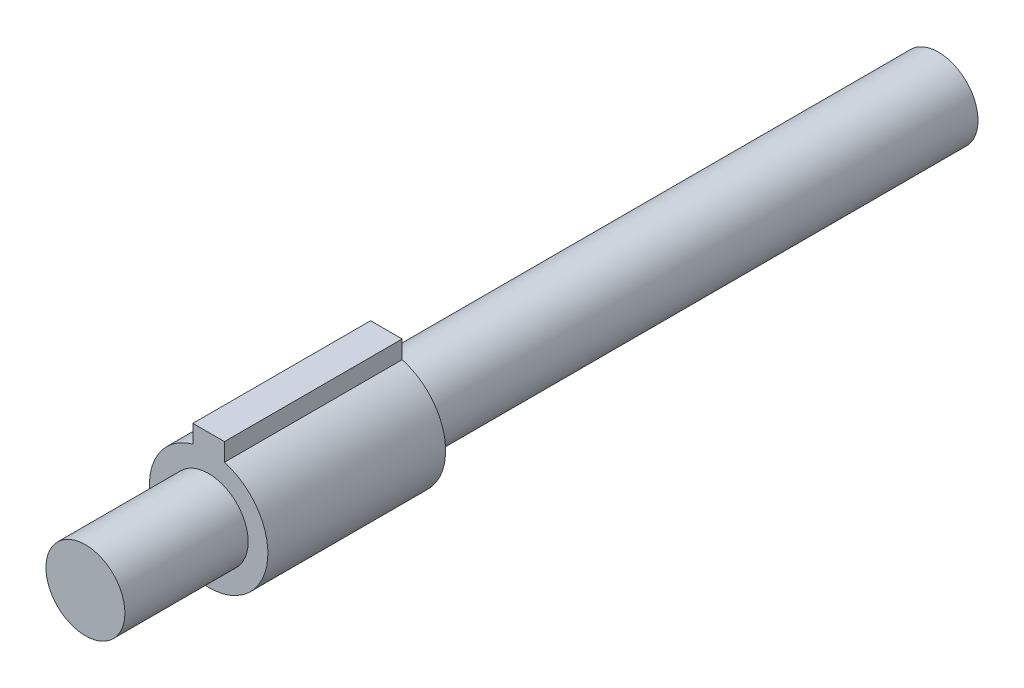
ISO-10303-21;
HEADER;
FILE_DESCRIPTION(('STEP AP214'),'2;1');
FILE_NAME('part.step','',(''),(''),'','','');
FILE_SCHEMA(('AUTOMOTIVE_DESIGN { 1 0 10303 214 1 1 1 1 }'));
ENDSEC;
DATA;
#1=APPLICATION_CONTEXT('core data for automotive mechanical design processes');
#2=APPLICATION_PROTOCOL_DEFINITION('international standard','automotive_design',2000,#1);
#3=PRODUCT_CONTEXT('',#1,'mechanical');
#4=PRODUCT('Part','Part','',(#3));
#5=PRODUCT_RELATED_PRODUCT_CATEGORY('part','',(#4));
#6=PRODUCT_DEFINITION_FORMATION('','',#4);
#7=PRODUCT_DEFINITION_CONTEXT('part definition',#1,'design');
#8=PRODUCT_DEFINITION('design','',#6,#7);
#9=PRODUCT_DEFINITION_SHAPE('','',#8);
#10=(LENGTH_UNIT() NAMED_UNIT(*) SI_UNIT(.MILLI.,.METRE.));
#11=(NAMED_UNIT(*) PLANE_ANGLE_UNIT() SI_UNIT($,.RADIAN.));
#12=(NAMED_UNIT(*) SI_UNIT($,.STERADIAN.) SOLID_ANGLE_UNIT());
#13=UNCERTAINTY_MEASURE_WITH_UNIT(LENGTH_MEASURE(1.E-05),#10,'distance_accuracy_value','');
#14=(GEOMETRIC_REPRESENTATION_CONTEXT(3) GLOBAL_UNCERTAINTY_ASSIGNED_CONTEXT((#13)) GLOBAL_UNIT_ASSIGNED_CONTEXT((#10,
#11,#12)) REPRESENTATION_CONTEXT('',''));
#15=CARTESIAN_POINT('',(0.,0.,0.));
#16=DIRECTION('',(0.,0.,1.));
#17=DIRECTION('',(1.,0.,0.));
#18=AXIS2_PLACEMENT_3D('',#15,#16,#17);
#19=CARTESIAN_POINT('',(5.08,24.13,57.15));
#20=DIRECTION('',(-1.,0.,0.));
#21=DIRECTION('',(0.,0.,1.));
#22=AXIS2_PLACEMENT_3D('',#19,#20,#21);
#23=PLANE('',#22);
#24=DIRECTION('',(0.,1.,0.));
#25=VECTOR('',#24,1.);
#26=CARTESIAN_POINT('',(5.08,24.13,0.));
#27=LINE('',#26,#25);
#28=CARTESIAN_POINT('',(5.08,18.3601770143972,0.));
#29=VERTEX_POINT('',#28);
#30=CARTESIAN_POINT('',(5.08,24.13,0.));
#31=VERTEX_POINT('',#30);
#32=EDGE_CURVE('E100',#29,#31,#27,.T.);
#33=ORIENTED_EDGE('',*,*,#32,.T.);
#34=DIRECTION('',(0.,0.,-1.));
#35=VECTOR('',#34,1.);
#36=CARTESIAN_POINT('',(5.08,24.13,57.15));
#37=LINE('',#36,#35);
#38=CARTESIAN_POINT('',(5.08,24.13,57.15));
#39=VERTEX_POINT('',#38);
#40=EDGE_CURVE('E42',#39,#31,#37,.T.);
#41=ORIENTED_EDGE('',*,*,#40,.F.);
#42=DIRECTION('',(0.,1.,0.));
#43=VECTOR('',#42,1.);
#44=CARTESIAN_POINT('',(5.08,24.13,57.15));
#45=LINE('',#44,#43);
#46=CARTESIAN_POINT('',(5.08,18.3601770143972,57.15));
#47=VERTEX_POINT('',#46);
#48=EDGE_CURVE('E86',#47,#39,#45,.T.);
#49=ORIENTED_EDGE('',*,*,#48,.F.);
#50=DIRECTION('',(0.,0.,-1.));
#51=VECTOR('',#50,1.);
#52=CARTESIAN_POINT('',(5.08,18.3601770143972,57.15));
#53=LINE('',#52,#51);
#54=EDGE_CURVE('E96',#47,#29,#53,.T.);
#55=ORIENTED_EDGE('',*,*,#54,.T.);
#56=EDGE_LOOP('',(#33,#41,#49,#55));
#57=FACE_BOUND('',#56,.T.);
#58=ADVANCED_FACE('F34',(#57),#23,.F.);
#59=CARTESIAN_POINT('',(5.08,24.13,57.15));
#60=DIRECTION('',(0.,-1.,0.));
#61=DIRECTION('',(1.,0.,0.));
#62=AXIS2_PLACEMENT_3D('',#59,#60,#61);
#63=PLANE('',#62);
#64=DIRECTION('',(-1.,0.,0.));
#65=VECTOR('',#64,1.);
#66=CARTESIAN_POINT('',(5.08,24.13,0.));
#67=LINE('',#66,#65);
#68=CARTESIAN_POINT('',(-5.08,24.13,0.));
#69=VERTEX_POINT('',#68);
#70=EDGE_CURVE('E91',#31,#69,#67,.T.);
#71=ORIENTED_EDGE('',*,*,#70,.T.);
#72=DIRECTION('',(0.,0.,-1.));
#73=VECTOR('',#72,1.);
#74=CARTESIAN_POINT('',(-5.08,24.13,57.15));
#75=LINE('',#74,#73);
#76=CARTESIAN_POINT('',(-5.08,24.13,57.15));
#77=VERTEX_POINT('',#76);
#78=EDGE_CURVE('E89',#77,#69,#75,.T.);
#79=ORIENTED_EDGE('',*,*,#78,.F.);
#80=DIRECTION('',(-1.,0.,0.));
#81=VECTOR('',#80,1.);
#82=CARTESIAN_POINT('',(5.08,24.13,57.15));
#83=LINE('',#82,#81);
#84=EDGE_CURVE('E81',#39,#77,#83,.T.);
#85=ORIENTED_EDGE('',*,*,#84,.F.);
#86=ORIENTED_EDGE('',*,*,#40,.T.);
#87=EDGE_LOOP('',(#71,#79,#85,#86));
#88=FACE_BOUND('',#87,.T.);
#89=ADVANCED_FACE('F90',(#88),#63,.F.);
#90=CARTESIAN_POINT('',(-5.08,24.13,57.15));
#91=DIRECTION('',(1.,0.,0.));
#92=DIRECTION('',(0.,1.,0.));
#93=AXIS2_PLACEMENT_3D('',#90,#91,#92);
#94=PLANE('',#93);
#95=DIRECTION('',(0.,-1.,0.));
#96=VECTOR('',#95,1.);
#97=CARTESIAN_POINT('',(-5.08,24.13,0.));
#98=LINE('',#97,#96);
#99=CARTESIAN_POINT('',(-5.08,18.3601770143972,0.));
#100=VERTEX_POINT('',#99);
#101=EDGE_CURVE('E67',#69,#100,#98,.T.);
#102=ORIENTED_EDGE('',*,*,#101,.T.);
#103=DIRECTION('',(0.,0.,-1.));
#104=VECTOR('',#103,1.);
#105=CARTESIAN_POINT('',(-5.08,18.3601770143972,57.15));
#106=LINE('',#105,#104);
#107=CARTESIAN_POINT('',(-5.08,18.3601770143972,57.15));
#108=VERTEX_POINT('',#107);
#109=EDGE_CURVE('E92',#108,#100,#106,.T.);
#110=ORIENTED_EDGE('',*,*,#109,.F.);
#111=DIRECTION('',(0.,-1.,0.));
#112=VECTOR('',#111,1.);
#113=CARTESIAN_POINT('',(-5.08,24.13,57.15));
#114=LINE('',#113,#112);
#115=EDGE_CURVE('E84',#77,#108,#114,.T.);
#116=ORIENTED_EDGE('',*,*,#115,.F.);
#117=ORIENTED_EDGE('',*,*,#78,.T.);
#118=EDGE_LOOP('',(#102,#110,#116,#117));
#119=FACE_BOUND('',#118,.T.);
#120=ADVANCED_FACE('F94',(#119),#94,.F.);
#121=CARTESIAN_POINT('',(0.,0.,57.15));
#122=DIRECTION('',(0.,0.,-1.));
#123=DIRECTION('',(-1.,0.,0.));
#124=AXIS2_PLACEMENT_3D('',#121,#122,#123);
#125=CYLINDRICAL_SURFACE('',#124,19.05);
#126=CARTESIAN_POINT('',(0.,0.,0.));
#127=DIRECTION('',(0.,0.,1.));
#128=DIRECTION('',(1.,0.,0.));
#129=AXIS2_PLACEMENT_3D('',#126,#127,#128);
#130=CIRCLE('',#129,19.05);
#131=EDGE_CURVE('E73',#100,#29,#130,.T.);
#132=ORIENTED_EDGE('',*,*,#131,.T.);
#133=ORIENTED_EDGE('',*,*,#54,.F.);
#134=CARTESIAN_POINT('',(0.,0.,57.15));
#135=DIRECTION('',(0.,0.,1.));
#136=DIRECTION('',(1.,0.,0.));
#137=AXIS2_PLACEMENT_3D('',#134,#135,#136);
#138=CIRCLE('',#137,19.05);
#139=EDGE_CURVE('E50',#108,#47,#138,.T.);
#140=ORIENTED_EDGE('',*,*,#139,.F.);
#141=ORIENTED_EDGE('',*,*,#109,.T.);
#142=EDGE_LOOP('',(#132,#133,#140,#141));
#143=FACE_BOUND('',#142,.T.);
#144=ADVANCED_FACE('F123',(#143),#125,.T.);
#145=CARTESIAN_POINT('',(0.,0.,57.15));
#146=DIRECTION('',(0.,0.,1.));
#147=DIRECTION('',(1.,0.,0.));
#148=AXIS2_PLACEMENT_3D('',#145,#146,#147);
#149=PLANE('',#148);
#150=CARTESIAN_POINT('',(0.,0.,57.15));
#151=DIRECTION('',(0.,0.,1.));
#152=DIRECTION('',(1.,0.,0.));
#153=AXIS2_PLACEMENT_3D('',#150,#151,#152);
#154=CIRCLE('',#153,12.7);
#155=CARTESIAN_POINT('',(12.7,0.,57.15));
#156=VERTEX_POINT('',#155);
#157=EDGE_CURVE('E191',#156,#156,#154,.T.);
#158=ORIENTED_EDGE('',*,*,#157,.F.);
#159=EDGE_LOOP('',(#158));
#160=FACE_BOUND('',#159,.T.);
#161=ORIENTED_EDGE('',*,*,#48,.T.);
#162=ORIENTED_EDGE('',*,*,#84,.T.);
#163=ORIENTED_EDGE('',*,*,#115,.T.);
#164=ORIENTED_EDGE('',*,*,#139,.T.);
#165=EDGE_LOOP('',(#161,#162,#163,#164));
#166=FACE_BOUND('',#165,.T.);
#167=ADVANCED_FACE('F82',(#160,#166),#149,.T.);
#168=CARTESIAN_POINT('',(0.,0.,0.));
#169=DIRECTION('',(0.,0.,1.));
#170=DIRECTION('',(1.,0.,0.));
#171=AXIS2_PLACEMENT_3D('',#168,#169,#170);
#172=PLANE('',#171);
#173=CARTESIAN_POINT('',(0.,0.,0.));
#174=DIRECTION('',(0.,0.,1.));
#175=DIRECTION('',(1.,0.,0.));
#176=AXIS2_PLACEMENT_3D('',#173,#174,#175);
#177=CIRCLE('',#176,12.7);
#178=CARTESIAN_POINT('',(12.7,0.,0.));
#179=VERTEX_POINT('',#178);
#180=EDGE_CURVE('E11',#179,#179,#177,.F.);
#181=ORIENTED_EDGE('',*,*,#180,.F.);
#182=EDGE_LOOP('',(#181));
#183=FACE_BOUND('',#182,.T.);
#184=ORIENTED_EDGE('',*,*,#32,.F.);
#185=ORIENTED_EDGE('',*,*,#131,.F.);
#186=ORIENTED_EDGE('',*,*,#101,.F.);
#187=ORIENTED_EDGE('',*,*,#70,.F.);
#188=EDGE_LOOP('',(#184,#185,#186,#187));
#189=FACE_BOUND('',#188,.T.);
#190=ADVANCED_FACE('F111',(#183,#189),#172,.F.);
#191=CARTESIAN_POINT('',(0.,0.,96.774));
#192=DIRECTION('',(0.,0.,-1.));
#193=DIRECTION('',(-1.,0.,0.));
#194=AXIS2_PLACEMENT_3D('',#191,#192,#193);
#195=CYLINDRICAL_SURFACE('',#194,12.7);
#196=CARTESIAN_POINT('',(0.,0.,96.774));
#197=DIRECTION('',(0.,0.,1.));
#198=DIRECTION('',(1.,0.,0.));
#199=AXIS2_PLACEMENT_3D('',#196,#197,#198);
#200=CIRCLE('',#199,12.7);
#201=CARTESIAN_POINT('',(12.7,0.,96.774));
#202=VERTEX_POINT('',#201);
#203=EDGE_CURVE('E103',#202,#202,#200,.T.);
#204=ORIENTED_EDGE('',*,*,#203,.F.);
#205=EDGE_LOOP('',(#204));
#206=FACE_BOUND('',#205,.T.);
#207=ORIENTED_EDGE('',*,*,#157,.T.);
#208=EDGE_LOOP('',(#207));
#209=FACE_BOUND('',#208,.T.);
#210=ADVANCED_FACE('F113',(#206,#209),#195,.T.);
#211=CARTESIAN_POINT('',(0.,0.,96.774));
#212=DIRECTION('',(0.,0.,1.));
#213=DIRECTION('',(1.,0.,0.));
#214=AXIS2_PLACEMENT_3D('',#211,#212,#213);
#215=PLANE('',#214);
#216=ORIENTED_EDGE('',*,*,#203,.T.);
#217=EDGE_LOOP('',(#216));
#218=FACE_BOUND('',#217,.T.);
#219=ADVANCED_FACE('F120',(#218),#215,.T.);
#220=CARTESIAN_POINT('',(0.,0.,-177.546));
#221=DIRECTION('',(0.,0.,1.));
#222=DIRECTION('',(1.,0.,0.));
#223=AXIS2_PLACEMENT_3D('',#220,#221,#222);
#224=CYLINDRICAL_SURFACE('',#223,12.7);
#225=CARTESIAN_POINT('',(0.,0.,-177.546));
#226=DIRECTION('',(0.,0.,-1.));
#227=DIRECTION('',(-1.,0.,0.));
#228=AXIS2_PLACEMENT_3D('',#225,#226,#227);
#229=CIRCLE('',#228,12.7);
#230=CARTESIAN_POINT('',(-12.7,0.,-177.546));
#231=VERTEX_POINT('',#230);
#232=EDGE_CURVE('E190',#231,#231,#229,.T.);
#233=ORIENTED_EDGE('',*,*,#232,.F.);
#234=EDGE_LOOP('',(#233));
#235=FACE_BOUND('',#234,.T.);
#236=ORIENTED_EDGE('',*,*,#180,.T.);
#237=EDGE_LOOP('',(#236));
#238=FACE_BOUND('',#237,.T.);
#239=ADVANCED_FACE('F160',(#235,#238),#224,.T.);
#240=CARTESIAN_POINT('',(0.,0.,-177.546));
#241=DIRECTION('',(0.,0.,-1.));
#242=DIRECTION('',(-1.,0.,0.));
#243=AXIS2_PLACEMENT_3D('',#240,#241,#242);
#244=PLANE('',#243);
#245=ORIENTED_EDGE('',*,*,#232,.T.);
#246=EDGE_LOOP('',(#245));
#247=FACE_BOUND('',#246,.T.);
#248=ADVANCED_FACE('F174',(#247),#244,.T.);
#249=CLOSED_SHELL('',(#58,#89,#120,#144,#167,#190,#210,#219,#239,#248));
#250=MANIFOLD_SOLID_BREP('B2',#249);
#251=ADVANCED_BREP_SHAPE_REPRESENTATION('',(#18,#250),#14);
#252=SHAPE_DEFINITION_REPRESENTATION(#9,#251);
ENDSEC;
END-ISO-10303-21;
